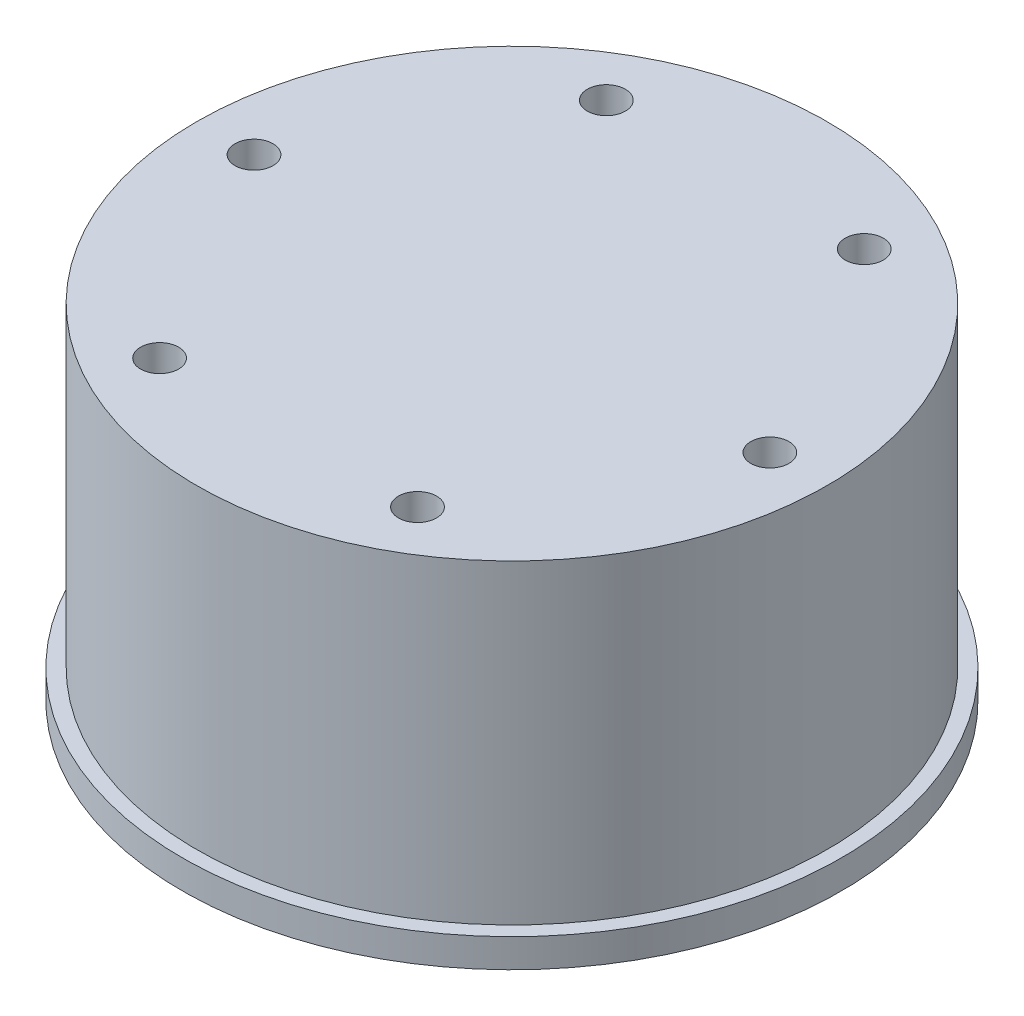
ISO-10303-21;
HEADER;
FILE_DESCRIPTION(('STEP AP214'),'2;1');
FILE_NAME('part.step','',(''),(''),'','','');
FILE_SCHEMA(('AUTOMOTIVE_DESIGN { 1 0 10303 214 1 1 1 1 }'));
ENDSEC;
DATA;
#1=APPLICATION_CONTEXT('core data for automotive mechanical design processes');
#2=APPLICATION_PROTOCOL_DEFINITION('international standard','automotive_design',2000,#1);
#3=PRODUCT_CONTEXT('',#1,'mechanical');
#4=PRODUCT('Part','Part','',(#3));
#5=PRODUCT_RELATED_PRODUCT_CATEGORY('part','',(#4));
#6=PRODUCT_DEFINITION_FORMATION('','',#4);
#7=PRODUCT_DEFINITION_CONTEXT('part definition',#1,'design');
#8=PRODUCT_DEFINITION('design','',#6,#7);
#9=PRODUCT_DEFINITION_SHAPE('','',#8);
#10=(LENGTH_UNIT() NAMED_UNIT(*) SI_UNIT(.MILLI.,.METRE.));
#11=(NAMED_UNIT(*) PLANE_ANGLE_UNIT() SI_UNIT($,.RADIAN.));
#12=(NAMED_UNIT(*) SI_UNIT($,.STERADIAN.) SOLID_ANGLE_UNIT());
#13=UNCERTAINTY_MEASURE_WITH_UNIT(LENGTH_MEASURE(1.E-05),#10,'distance_accuracy_value','');
#14=(GEOMETRIC_REPRESENTATION_CONTEXT(3) GLOBAL_UNCERTAINTY_ASSIGNED_CONTEXT((#13)) GLOBAL_UNIT_ASSIGNED_CONTEXT((#10,
#11,#12)) REPRESENTATION_CONTEXT('',''));
#15=CARTESIAN_POINT('',(0.,0.,0.));
#16=DIRECTION('',(0.,0.,1.));
#17=DIRECTION('',(1.,0.,0.));
#18=AXIS2_PLACEMENT_3D('',#15,#16,#17);
#19=CARTESIAN_POINT('',(69.85,6.35,0.));
#20=DIRECTION('',(0.,-1.,0.));
#21=DIRECTION('',(1.,0.,0.));
#22=AXIS2_PLACEMENT_3D('',#19,#20,#21);
#23=PLANE('',#22);
#24=CARTESIAN_POINT('',(0.,6.35000000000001,0.));
#25=DIRECTION('',(0.,1.,0.));
#26=DIRECTION('',(-1.,0.,0.));
#27=AXIS2_PLACEMENT_3D('',#24,#25,#26);
#28=CIRCLE('',#27,69.85);
#29=CARTESIAN_POINT('',(-69.85,6.35000000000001,0.));
#30=VERTEX_POINT('',#29);
#31=EDGE_CURVE('E99',#30,#30,#28,.T.);
#32=ORIENTED_EDGE('',*,*,#31,.F.);
#33=EDGE_LOOP('',(#32));
#34=FACE_BOUND('',#33,.T.);
#35=CARTESIAN_POINT('',(0.,6.34999999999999,0.));
#36=DIRECTION('',(0.,1.,0.));
#37=DIRECTION('',(-1.,0.,0.));
#38=AXIS2_PLACEMENT_3D('',#35,#36,#37);
#39=CIRCLE('',#38,73.025);
#40=CARTESIAN_POINT('',(-73.025,6.34999999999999,0.));
#41=VERTEX_POINT('',#40);
#42=EDGE_CURVE('E11',#41,#41,#39,.T.);
#43=ORIENTED_EDGE('',*,*,#42,.T.);
#44=EDGE_LOOP('',(#43));
#45=FACE_BOUND('',#44,.T.);
#46=ADVANCED_FACE('F28',(#34,#45),#23,.F.);
#47=CARTESIAN_POINT('',(0.,76.2,0.));
#48=DIRECTION('',(0.,1.,0.));
#49=DIRECTION('',(-1.,0.,0.));
#50=AXIS2_PLACEMENT_3D('',#47,#48,#49);
#51=CYLINDRICAL_SURFACE('',#50,73.025);
#52=ORIENTED_EDGE('',*,*,#42,.F.);
#53=EDGE_LOOP('',(#52));
#54=FACE_BOUND('',#53,.T.);
#55=CARTESIAN_POINT('',(0.,0.,0.));
#56=DIRECTION('',(0.,1.,0.));
#57=DIRECTION('',(-1.,0.,0.));
#58=AXIS2_PLACEMENT_3D('',#55,#56,#57);
#59=CIRCLE('',#58,73.025);
#60=CARTESIAN_POINT('',(-73.025,0.,0.));
#61=VERTEX_POINT('',#60);
#62=EDGE_CURVE('E35',#61,#61,#59,.T.);
#63=ORIENTED_EDGE('',*,*,#62,.T.);
#64=EDGE_LOOP('',(#63));
#65=FACE_BOUND('',#64,.T.);
#66=ADVANCED_FACE('F107',(#54,#65),#51,.T.);
#67=CARTESIAN_POINT('',(73.025,0.,0.));
#68=DIRECTION('',(0.,1.,0.));
#69=DIRECTION('',(-1.,0.,0.));
#70=AXIS2_PLACEMENT_3D('',#67,#68,#69);
#71=PLANE('',#70);
#72=ORIENTED_EDGE('',*,*,#62,.F.);
#73=EDGE_LOOP('',(#72));
#74=FACE_BOUND('',#73,.T.);
#75=ADVANCED_FACE('F109',(#74),#71,.F.);
#76=CARTESIAN_POINT('',(0.,76.2,0.));
#77=DIRECTION('',(0.,-1.,0.));
#78=DIRECTION('',(1.,0.,0.));
#79=AXIS2_PLACEMENT_3D('',#76,#77,#78);
#80=PLANE('',#79);
#81=CARTESIAN_POINT('',(-28.5750000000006,76.2,49.4933518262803));
#82=DIRECTION('',(0.,1.,0.));
#83=DIRECTION('',(0.866025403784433,0.,0.50000000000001));
#84=AXIS2_PLACEMENT_3D('',#81,#82,#83);
#85=CIRCLE('',#84,4.21639999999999);
#86=CARTESIAN_POINT('',(-24.9234904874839,76.2,51.6015518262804));
#87=VERTEX_POINT('',#86);
#88=EDGE_CURVE('E65',#87,#87,#85,.T.);
#89=ORIENTED_EDGE('',*,*,#88,.F.);
#90=EDGE_LOOP('',(#89));
#91=FACE_BOUND('',#90,.T.);
#92=CARTESIAN_POINT('',(28.5749999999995,76.2,49.4933518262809));
#93=DIRECTION('',(0.,1.,0.));
#94=DIRECTION('',(0.866025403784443,0.,-0.499999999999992));
#95=AXIS2_PLACEMENT_3D('',#92,#93,#94);
#96=CIRCLE('',#95,4.21639999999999);
#97=CARTESIAN_POINT('',(32.2265095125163,76.2,47.385151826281));
#98=VERTEX_POINT('',#97);
#99=EDGE_CURVE('E64',#98,#98,#96,.T.);
#100=ORIENTED_EDGE('',*,*,#99,.F.);
#101=EDGE_LOOP('',(#100));
#102=FACE_BOUND('',#101,.T.);
#103=CARTESIAN_POINT('',(57.15,76.2,3.99076548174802E-13));
#104=DIRECTION('',(0.,1.,0.));
#105=DIRECTION('',(0.,0.,-1.));
#106=AXIS2_PLACEMENT_3D('',#103,#104,#105);
#107=CIRCLE('',#106,4.21639999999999);
#108=CARTESIAN_POINT('',(57.15,76.2,-4.21639999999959));
#109=VERTEX_POINT('',#108);
#110=EDGE_CURVE('E75',#109,#109,#107,.T.);
#111=ORIENTED_EDGE('',*,*,#110,.F.);
#112=EDGE_LOOP('',(#111));
#113=FACE_BOUND('',#112,.T.);
#114=CARTESIAN_POINT('',(28.5750000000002,76.2,-49.4933518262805));
#115=DIRECTION('',(0.,1.,0.));
#116=DIRECTION('',(-0.866025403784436,0.,-0.500000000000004));
#117=AXIS2_PLACEMENT_3D('',#114,#115,#116);
#118=CIRCLE('',#117,4.21639999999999);
#119=CARTESIAN_POINT('',(24.9234904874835,76.2,-51.6015518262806));
#120=VERTEX_POINT('',#119);
#121=EDGE_CURVE('E81',#120,#120,#118,.T.);
#122=ORIENTED_EDGE('',*,*,#121,.F.);
#123=EDGE_LOOP('',(#122));
#124=FACE_BOUND('',#123,.T.);
#125=CARTESIAN_POINT('',(-28.5749999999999,76.2,-49.4933518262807));
#126=DIRECTION('',(0.,1.,0.));
#127=DIRECTION('',(-0.86602540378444,0.,0.499999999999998));
#128=AXIS2_PLACEMENT_3D('',#125,#126,#127);
#129=CIRCLE('',#128,4.21639999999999);
#130=CARTESIAN_POINT('',(-32.2265095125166,76.2,-47.3851518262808));
#131=VERTEX_POINT('',#130);
#132=EDGE_CURVE('E87',#131,#131,#129,.T.);
#133=ORIENTED_EDGE('',*,*,#132,.F.);
#134=EDGE_LOOP('',(#133));
#135=FACE_BOUND('',#134,.T.);
#136=CARTESIAN_POINT('',(-57.15,76.2,0.));
#137=DIRECTION('',(0.,1.,0.));
#138=DIRECTION('',(0.,0.,1.));
#139=AXIS2_PLACEMENT_3D('',#136,#137,#138);
#140=CIRCLE('',#139,4.21639999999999);
#141=CARTESIAN_POINT('',(-57.15,76.2,4.21639999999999));
#142=VERTEX_POINT('',#141);
#143=EDGE_CURVE('E96',#142,#142,#140,.T.);
#144=ORIENTED_EDGE('',*,*,#143,.F.);
#145=EDGE_LOOP('',(#144));
#146=FACE_BOUND('',#145,.T.);
#147=CARTESIAN_POINT('',(0.,76.2,0.));
#148=DIRECTION('',(0.,1.,0.));
#149=DIRECTION('',(-1.,0.,0.));
#150=AXIS2_PLACEMENT_3D('',#147,#148,#149);
#151=CIRCLE('',#150,69.85);
#152=CARTESIAN_POINT('',(-69.85,76.2,0.));
#153=VERTEX_POINT('',#152);
#154=EDGE_CURVE('E102',#153,#153,#151,.T.);
#155=ORIENTED_EDGE('',*,*,#154,.T.);
#156=EDGE_LOOP('',(#155));
#157=FACE_BOUND('',#156,.T.);
#158=ADVANCED_FACE('F111',(#91,#102,#113,#124,#135,#146,#157),#80,.F.);
#159=CARTESIAN_POINT('',(0.,76.2,0.));
#160=DIRECTION('',(0.,1.,0.));
#161=DIRECTION('',(-1.,0.,0.));
#162=AXIS2_PLACEMENT_3D('',#159,#160,#161);
#163=CYLINDRICAL_SURFACE('',#162,69.85);
#164=ORIENTED_EDGE('',*,*,#154,.F.);
#165=EDGE_LOOP('',(#164));
#166=FACE_BOUND('',#165,.T.);
#167=ORIENTED_EDGE('',*,*,#31,.T.);
#168=EDGE_LOOP('',(#167));
#169=FACE_BOUND('',#168,.T.);
#170=ADVANCED_FACE('F118',(#166,#169),#163,.T.);
#171=CARTESIAN_POINT('',(-57.15,76.2,0.));
#172=DIRECTION('',(0.,1.,0.));
#173=DIRECTION('',(0.,0.,1.));
#174=AXIS2_PLACEMENT_3D('',#171,#172,#173);
#175=CYLINDRICAL_SURFACE('',#174,4.21639999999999);
#176=CARTESIAN_POINT('',(-57.15,51.8541,0.));
#177=DIRECTION('',(0.,1.,0.));
#178=DIRECTION('',(0.,0.,1.));
#179=AXIS2_PLACEMENT_3D('',#176,#177,#178);
#180=CIRCLE('',#179,4.21639999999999);
#181=CARTESIAN_POINT('',(-57.15,51.8541,4.21639999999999));
#182=VERTEX_POINT('',#181);
#183=EDGE_CURVE('E93',#182,#182,#180,.T.);
#184=ORIENTED_EDGE('',*,*,#183,.F.);
#185=EDGE_LOOP('',(#184));
#186=FACE_BOUND('',#185,.T.);
#187=ORIENTED_EDGE('',*,*,#143,.T.);
#188=EDGE_LOOP('',(#187));
#189=FACE_BOUND('',#188,.T.);
#190=ADVANCED_FACE('F130',(#186,#189),#175,.F.);
#191=CARTESIAN_POINT('',(-57.15,51.8541,0.));
#192=DIRECTION('',(0.,1.,0.));
#193=DIRECTION('',(0.,0.,1.));
#194=AXIS2_PLACEMENT_3D('',#191,#192,#193);
#195=CONICAL_SURFACE('',#194,4.21639999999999,1.02974425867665);
#196=CARTESIAN_POINT('',(-57.15,49.3206312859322,0.));
#197=VERTEX_POINT('',#196);
#198=VERTEX_LOOP('',#197);
#199=FACE_BOUND('',#198,.T.);
#200=ORIENTED_EDGE('',*,*,#183,.T.);
#201=EDGE_LOOP('',(#200));
#202=FACE_BOUND('',#201,.T.);
#203=ADVANCED_FACE('F137',(#199,#202),#195,.F.);
#204=CARTESIAN_POINT('',(-28.5749999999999,76.2,-49.4933518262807));
#205=DIRECTION('',(0.,1.,0.));
#206=DIRECTION('',(-0.86602540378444,0.,0.499999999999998));
#207=AXIS2_PLACEMENT_3D('',#204,#205,#206);
#208=CYLINDRICAL_SURFACE('',#207,4.21639999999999);
#209=CARTESIAN_POINT('',(-28.5749999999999,51.8541,-49.4933518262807));
#210=DIRECTION('',(0.,1.,0.));
#211=DIRECTION('',(-0.86602540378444,0.,0.499999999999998));
#212=AXIS2_PLACEMENT_3D('',#209,#210,#211);
#213=CIRCLE('',#212,4.21639999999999);
#214=CARTESIAN_POINT('',(-32.2265095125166,51.8541,-47.3851518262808));
#215=VERTEX_POINT('',#214);
#216=EDGE_CURVE('E90',#215,#215,#213,.T.);
#217=ORIENTED_EDGE('',*,*,#216,.F.);
#218=EDGE_LOOP('',(#217));
#219=FACE_BOUND('',#218,.T.);
#220=ORIENTED_EDGE('',*,*,#132,.T.);
#221=EDGE_LOOP('',(#220));
#222=FACE_BOUND('',#221,.T.);
#223=ADVANCED_FACE('F144',(#219,#222),#208,.F.);
#224=CARTESIAN_POINT('',(-28.5749999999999,51.8541,-49.4933518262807));
#225=DIRECTION('',(0.,1.,0.));
#226=DIRECTION('',(-0.86602540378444,0.,0.499999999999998));
#227=AXIS2_PLACEMENT_3D('',#224,#225,#226);
#228=CONICAL_SURFACE('',#227,4.21639999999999,1.02974425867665);
#229=CARTESIAN_POINT('',(-28.5749999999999,49.3206312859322,-49.4933518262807));
#230=VERTEX_POINT('',#229);
#231=VERTEX_LOOP('',#230);
#232=FACE_BOUND('',#231,.T.);
#233=ORIENTED_EDGE('',*,*,#216,.T.);
#234=EDGE_LOOP('',(#233));
#235=FACE_BOUND('',#234,.T.);
#236=ADVANCED_FACE('F145',(#232,#235),#228,.F.);
#237=CARTESIAN_POINT('',(28.5750000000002,76.2,-49.4933518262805));
#238=DIRECTION('',(0.,1.,0.));
#239=DIRECTION('',(-0.866025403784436,0.,-0.500000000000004));
#240=AXIS2_PLACEMENT_3D('',#237,#238,#239);
#241=CYLINDRICAL_SURFACE('',#240,4.21639999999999);
#242=CARTESIAN_POINT('',(28.5750000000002,51.8541,-49.4933518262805));
#243=DIRECTION('',(0.,1.,0.));
#244=DIRECTION('',(-0.866025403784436,0.,-0.500000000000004));
#245=AXIS2_PLACEMENT_3D('',#242,#243,#244);
#246=CIRCLE('',#245,4.21639999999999);
#247=CARTESIAN_POINT('',(24.9234904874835,51.8541,-51.6015518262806));
#248=VERTEX_POINT('',#247);
#249=EDGE_CURVE('E84',#248,#248,#246,.T.);
#250=ORIENTED_EDGE('',*,*,#249,.F.);
#251=EDGE_LOOP('',(#250));
#252=FACE_BOUND('',#251,.T.);
#253=ORIENTED_EDGE('',*,*,#121,.T.);
#254=EDGE_LOOP('',(#253));
#255=FACE_BOUND('',#254,.T.);
#256=ADVANCED_FACE('F152',(#252,#255),#241,.F.);
#257=CARTESIAN_POINT('',(28.5750000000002,51.8541,-49.4933518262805));
#258=DIRECTION('',(0.,1.,0.));
#259=DIRECTION('',(-0.866025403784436,0.,-0.500000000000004));
#260=AXIS2_PLACEMENT_3D('',#257,#258,#259);
#261=CONICAL_SURFACE('',#260,4.21639999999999,1.02974425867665);
#262=CARTESIAN_POINT('',(28.5750000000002,49.3206312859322,-49.4933518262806));
#263=VERTEX_POINT('',#262);
#264=VERTEX_LOOP('',#263);
#265=FACE_BOUND('',#264,.T.);
#266=ORIENTED_EDGE('',*,*,#249,.T.);
#267=EDGE_LOOP('',(#266));
#268=FACE_BOUND('',#267,.T.);
#269=ADVANCED_FACE('F149',(#265,#268),#261,.F.);
#270=CARTESIAN_POINT('',(57.15,76.2,3.99076548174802E-13));
#271=DIRECTION('',(0.,1.,0.));
#272=DIRECTION('',(0.,0.,-1.));
#273=AXIS2_PLACEMENT_3D('',#270,#271,#272);
#274=CYLINDRICAL_SURFACE('',#273,4.21639999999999);
#275=CARTESIAN_POINT('',(57.15,51.8541,3.99076548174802E-13));
#276=DIRECTION('',(0.,1.,0.));
#277=DIRECTION('',(0.,0.,-1.));
#278=AXIS2_PLACEMENT_3D('',#275,#276,#277);
#279=CIRCLE('',#278,4.21639999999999);
#280=CARTESIAN_POINT('',(57.15,51.8541,-4.21639999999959));
#281=VERTEX_POINT('',#280);
#282=EDGE_CURVE('E78',#281,#281,#279,.T.);
#283=ORIENTED_EDGE('',*,*,#282,.F.);
#284=EDGE_LOOP('',(#283));
#285=FACE_BOUND('',#284,.T.);
#286=ORIENTED_EDGE('',*,*,#110,.T.);
#287=EDGE_LOOP('',(#286));
#288=FACE_BOUND('',#287,.T.);
#289=ADVANCED_FACE('F159',(#285,#288),#274,.F.);
#290=CARTESIAN_POINT('',(57.15,51.8541,3.99076548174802E-13));
#291=DIRECTION('',(0.,1.,0.));
#292=DIRECTION('',(0.,0.,-1.));
#293=AXIS2_PLACEMENT_3D('',#290,#291,#292);
#294=CONICAL_SURFACE('',#293,4.21639999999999,1.02974425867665);
#295=CARTESIAN_POINT('',(57.15,49.3206312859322,3.99076548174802E-13));
#296=VERTEX_POINT('',#295);
#297=VERTEX_LOOP('',#296);
#298=FACE_BOUND('',#297,.T.);
#299=ORIENTED_EDGE('',*,*,#282,.T.);
#300=EDGE_LOOP('',(#299));
#301=FACE_BOUND('',#300,.T.);
#302=ADVANCED_FACE('F156',(#298,#301),#294,.F.);
#303=CARTESIAN_POINT('',(28.5749999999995,76.2,49.4933518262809));
#304=DIRECTION('',(0.,1.,0.));
#305=DIRECTION('',(0.866025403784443,0.,-0.499999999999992));
#306=AXIS2_PLACEMENT_3D('',#303,#304,#305);
#307=CYLINDRICAL_SURFACE('',#306,4.21639999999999);
#308=CARTESIAN_POINT('',(28.5749999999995,51.8541,49.4933518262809));
#309=DIRECTION('',(0.,1.,0.));
#310=DIRECTION('',(0.866025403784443,0.,-0.499999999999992));
#311=AXIS2_PLACEMENT_3D('',#308,#309,#310);
#312=CIRCLE('',#311,4.21639999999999);
#313=CARTESIAN_POINT('',(32.2265095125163,51.8541,47.385151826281));
#314=VERTEX_POINT('',#313);
#315=EDGE_CURVE('E68',#314,#314,#312,.T.);
#316=ORIENTED_EDGE('',*,*,#315,.F.);
#317=EDGE_LOOP('',(#316));
#318=FACE_BOUND('',#317,.T.);
#319=ORIENTED_EDGE('',*,*,#99,.T.);
#320=EDGE_LOOP('',(#319));
#321=FACE_BOUND('',#320,.T.);
#322=ADVANCED_FACE('F59',(#318,#321),#307,.F.);
#323=CARTESIAN_POINT('',(28.5749999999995,51.8541,49.4933518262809));
#324=DIRECTION('',(0.,1.,0.));
#325=DIRECTION('',(0.866025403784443,0.,-0.499999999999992));
#326=AXIS2_PLACEMENT_3D('',#323,#324,#325);
#327=CONICAL_SURFACE('',#326,4.21639999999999,1.02974425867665);
#328=CARTESIAN_POINT('',(28.5749999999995,49.3206312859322,49.4933518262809));
#329=VERTEX_POINT('',#328);
#330=VERTEX_LOOP('',#329);
#331=FACE_BOUND('',#330,.T.);
#332=ORIENTED_EDGE('',*,*,#315,.T.);
#333=EDGE_LOOP('',(#332));
#334=FACE_BOUND('',#333,.T.);
#335=ADVANCED_FACE('F164',(#331,#334),#327,.F.);
#336=CARTESIAN_POINT('',(-28.5750000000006,76.2,49.4933518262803));
#337=DIRECTION('',(0.,1.,0.));
#338=DIRECTION('',(0.866025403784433,0.,0.50000000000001));
#339=AXIS2_PLACEMENT_3D('',#336,#337,#338);
#340=CYLINDRICAL_SURFACE('',#339,4.21639999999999);
#341=CARTESIAN_POINT('',(-28.5750000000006,51.8541,49.4933518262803));
#342=DIRECTION('',(0.,1.,0.));
#343=DIRECTION('',(0.866025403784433,0.,0.50000000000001));
#344=AXIS2_PLACEMENT_3D('',#341,#342,#343);
#345=CIRCLE('',#344,4.21639999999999);
#346=CARTESIAN_POINT('',(-24.9234904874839,51.8541,51.6015518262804));
#347=VERTEX_POINT('',#346);
#348=EDGE_CURVE('E62',#347,#347,#345,.T.);
#349=ORIENTED_EDGE('',*,*,#348,.F.);
#350=EDGE_LOOP('',(#349));
#351=FACE_BOUND('',#350,.T.);
#352=ORIENTED_EDGE('',*,*,#88,.T.);
#353=EDGE_LOOP('',(#352));
#354=FACE_BOUND('',#353,.T.);
#355=ADVANCED_FACE('F57',(#351,#354),#340,.F.);
#356=CARTESIAN_POINT('',(-28.5750000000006,51.8541,49.4933518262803));
#357=DIRECTION('',(0.,1.,0.));
#358=DIRECTION('',(0.866025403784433,0.,0.50000000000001));
#359=AXIS2_PLACEMENT_3D('',#356,#357,#358);
#360=CONICAL_SURFACE('',#359,4.21639999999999,1.02974425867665);
#361=CARTESIAN_POINT('',(-28.5750000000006,49.3206312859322,49.4933518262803));
#362=VERTEX_POINT('',#361);
#363=VERTEX_LOOP('',#362);
#364=FACE_BOUND('',#363,.T.);
#365=ORIENTED_EDGE('',*,*,#348,.T.);
#366=EDGE_LOOP('',(#365));
#367=FACE_BOUND('',#366,.T.);
#368=ADVANCED_FACE('F54',(#364,#367),#360,.F.);
#369=CLOSED_SHELL('',(#46,#66,#75,#158,#170,#190,#203,#223,#236,#256,#269,#289,#302,#322,#335,
#355,#368));
#370=MANIFOLD_SOLID_BREP('B2',#369);
#371=ADVANCED_BREP_SHAPE_REPRESENTATION('',(#18,#370),#14);
#372=SHAPE_DEFINITION_REPRESENTATION(#9,#371);
ENDSEC;
END-ISO-10303-21;
